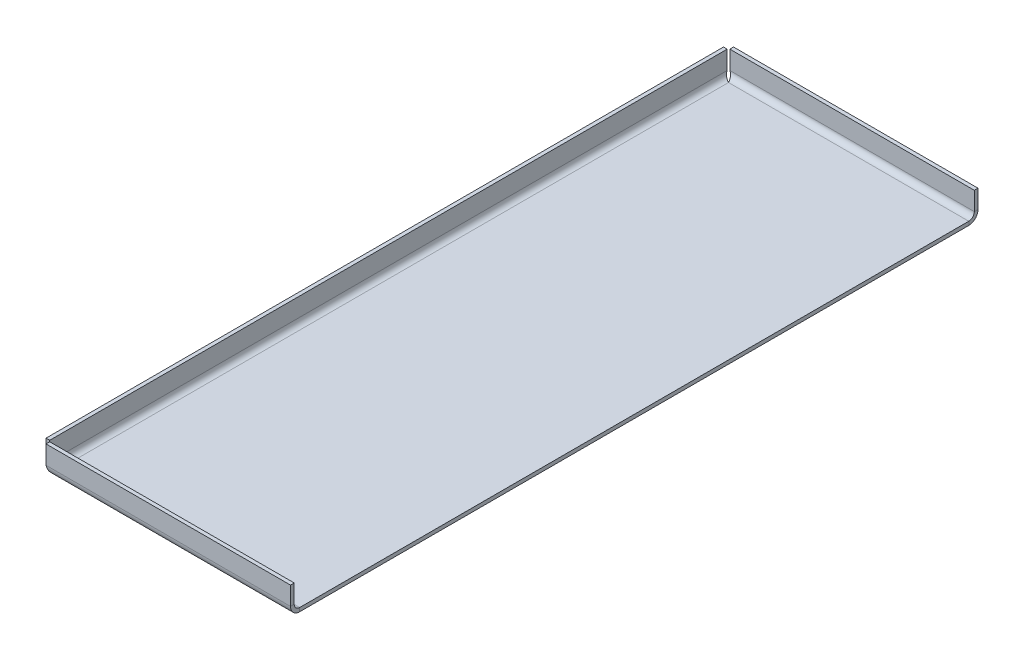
ISO-10303-21;
HEADER;
FILE_DESCRIPTION(('STEP AP214'),'2;1');
FILE_NAME('part.step','',(''),(''),'','','');
FILE_SCHEMA(('AUTOMOTIVE_DESIGN { 1 0 10303 214 1 1 1 1 }'));
ENDSEC;
DATA;
#1=APPLICATION_CONTEXT('core data for automotive mechanical design processes');
#2=APPLICATION_PROTOCOL_DEFINITION('international standard','automotive_design',2000,#1);
#3=PRODUCT_CONTEXT('',#1,'mechanical');
#4=PRODUCT('Part','Part','',(#3));
#5=PRODUCT_RELATED_PRODUCT_CATEGORY('part','',(#4));
#6=PRODUCT_DEFINITION_FORMATION('','',#4);
#7=PRODUCT_DEFINITION_CONTEXT('part definition',#1,'design');
#8=PRODUCT_DEFINITION('design','',#6,#7);
#9=PRODUCT_DEFINITION_SHAPE('','',#8);
#10=(LENGTH_UNIT() NAMED_UNIT(*) SI_UNIT(.MILLI.,.METRE.));
#11=(NAMED_UNIT(*) PLANE_ANGLE_UNIT() SI_UNIT($,.RADIAN.));
#12=(NAMED_UNIT(*) SI_UNIT($,.STERADIAN.) SOLID_ANGLE_UNIT());
#13=UNCERTAINTY_MEASURE_WITH_UNIT(LENGTH_MEASURE(1.E-05),#10,'distance_accuracy_value','');
#14=(GEOMETRIC_REPRESENTATION_CONTEXT(3) GLOBAL_UNCERTAINTY_ASSIGNED_CONTEXT((#13)) GLOBAL_UNIT_ASSIGNED_CONTEXT((#10,
#11,#12)) REPRESENTATION_CONTEXT('',''));
#15=CARTESIAN_POINT('',(0.,0.,0.));
#16=DIRECTION('',(0.,0.,1.));
#17=DIRECTION('',(1.,0.,0.));
#18=AXIS2_PLACEMENT_3D('',#15,#16,#17);
#19=CARTESIAN_POINT('',(-65.,-2.,181.));
#20=DIRECTION('',(0.,1.,0.));
#21=DIRECTION('',(-1.,0.,0.));
#22=AXIS2_PLACEMENT_3D('',#19,#20,#21);
#23=PLANE('',#22);
#24=DIRECTION('',(1.,0.,0.));
#25=VECTOR('',#24,1.);
#26=CARTESIAN_POINT('',(-65.,-2.,-181.));
#27=LINE('',#26,#25);
#28=CARTESIAN_POINT('',(-65.,-1.99999999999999,-181.));
#29=VERTEX_POINT('',#28);
#30=CARTESIAN_POINT('',(65.,-1.99999999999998,-181.));
#31=VERTEX_POINT('',#30);
#32=EDGE_CURVE('E314',#29,#31,#27,.T.);
#33=ORIENTED_EDGE('',*,*,#32,.T.);
#34=DIRECTION('',(0.,0.,-1.));
#35=VECTOR('',#34,1.);
#36=CARTESIAN_POINT('',(65.,-1.99999999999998,181.));
#37=LINE('',#36,#35);
#38=CARTESIAN_POINT('',(65.,-2.,181.));
#39=VERTEX_POINT('',#38);
#40=EDGE_CURVE('E15',#39,#31,#37,.T.);
#41=ORIENTED_EDGE('',*,*,#40,.F.);
#42=DIRECTION('',(1.,0.,0.));
#43=VECTOR('',#42,1.);
#44=CARTESIAN_POINT('',(-65.,-2.,181.));
#45=LINE('',#44,#43);
#46=CARTESIAN_POINT('',(-65.,-2.,181.));
#47=VERTEX_POINT('',#46);
#48=EDGE_CURVE('E334',#47,#39,#45,.T.);
#49=ORIENTED_EDGE('',*,*,#48,.F.);
#50=DIRECTION('',(0.,0.,-1.));
#51=VECTOR('',#50,1.);
#52=CARTESIAN_POINT('',(-65.,-2.,181.));
#53=LINE('',#52,#51);
#54=EDGE_CURVE('E317',#47,#29,#53,.T.);
#55=ORIENTED_EDGE('',*,*,#54,.T.);
#56=EDGE_LOOP('',(#33,#41,#49,#55));
#57=FACE_BOUND('',#56,.T.);
#58=ADVANCED_FACE('F106',(#57),#23,.F.);
#59=CARTESIAN_POINT('',(65.,0.,181.));
#60=DIRECTION('',(1.,0.,0.));
#61=DIRECTION('',(0.,0.,-1.));
#62=AXIS2_PLACEMENT_3D('',#59,#60,#61);
#63=PLANE('',#62);
#64=DIRECTION('',(0.,-1.,0.));
#65=VECTOR('',#64,1.);
#66=CARTESIAN_POINT('',(65.,0.,-181.));
#67=LINE('',#66,#65);
#68=CARTESIAN_POINT('',(65.,0.,-181.));
#69=VERTEX_POINT('',#68);
#70=EDGE_CURVE('E318',#69,#31,#67,.T.);
#71=ORIENTED_EDGE('',*,*,#70,.F.);
#72=DIRECTION('',(0.,0.,-1.));
#73=VECTOR('',#72,1.);
#74=CARTESIAN_POINT('',(65.,0.,181.));
#75=LINE('',#74,#73);
#76=CARTESIAN_POINT('',(65.,0.,181.));
#77=VERTEX_POINT('',#76);
#78=EDGE_CURVE('E114',#77,#69,#75,.T.);
#79=ORIENTED_EDGE('',*,*,#78,.F.);
#80=DIRECTION('',(0.,-1.,0.));
#81=VECTOR('',#80,1.);
#82=CARTESIAN_POINT('',(65.,0.,181.));
#83=LINE('',#82,#81);
#84=EDGE_CURVE('E457',#77,#39,#83,.T.);
#85=ORIENTED_EDGE('',*,*,#84,.T.);
#86=ORIENTED_EDGE('',*,*,#40,.T.);
#87=EDGE_LOOP('',(#71,#79,#85,#86));
#88=FACE_BOUND('',#87,.T.);
#89=ADVANCED_FACE('F305',(#88),#63,.T.);
#90=CARTESIAN_POINT('',(-65.,0.,181.));
#91=DIRECTION('',(0.,1.,0.));
#92=DIRECTION('',(-1.,0.,0.));
#93=AXIS2_PLACEMENT_3D('',#90,#91,#92);
#94=PLANE('',#93);
#95=DIRECTION('',(1.,0.,0.));
#96=VECTOR('',#95,1.);
#97=CARTESIAN_POINT('',(-65.,0.,-181.));
#98=LINE('',#97,#96);
#99=CARTESIAN_POINT('',(-65.,0.,-181.));
#100=VERTEX_POINT('',#99);
#101=EDGE_CURVE('E322',#100,#69,#98,.T.);
#102=ORIENTED_EDGE('',*,*,#101,.F.);
#103=DIRECTION('',(0.,0.,-1.));
#104=VECTOR('',#103,1.);
#105=CARTESIAN_POINT('',(-65.,0.,181.));
#106=LINE('',#105,#104);
#107=CARTESIAN_POINT('',(-65.,0.,181.));
#108=VERTEX_POINT('',#107);
#109=EDGE_CURVE('E336',#108,#100,#106,.T.);
#110=ORIENTED_EDGE('',*,*,#109,.F.);
#111=DIRECTION('',(1.,0.,0.));
#112=VECTOR('',#111,1.);
#113=CARTESIAN_POINT('',(-65.,0.,181.));
#114=LINE('',#113,#112);
#115=EDGE_CURVE('E342',#108,#77,#114,.T.);
#116=ORIENTED_EDGE('',*,*,#115,.T.);
#117=ORIENTED_EDGE('',*,*,#78,.T.);
#118=EDGE_LOOP('',(#102,#110,#116,#117));
#119=FACE_BOUND('',#118,.T.);
#120=ADVANCED_FACE('F310',(#119),#94,.T.);
#121=CARTESIAN_POINT('',(-65.,-2.02,181.));
#122=CARTESIAN_POINT('',(-65.1911062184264,-2.02,181.657225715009));
#123=CARTESIAN_POINT('',(-65.3821488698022,-1.88934283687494,182.313974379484));
#124=CARTESIAN_POINT('',(-65.7642977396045,-1.38640766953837,183.528167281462));
#125=CARTESIAN_POINT('',(-65.9553721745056,-1.01432754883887,184.085024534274));
#126=CARTESIAN_POINT('',(-66.3375210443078,-0.0850245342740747,185.014327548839));
#127=CARTESIAN_POINT('',(-66.528595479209,0.471832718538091,185.386407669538));
#128=CARTESIAN_POINT('',(-66.9107443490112,1.68602562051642,185.889342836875));
#129=CARTESIAN_POINT('',(-67.101787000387,2.34277428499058,186.02));
#130=CARTESIAN_POINT('',(-67.2928932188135,3.,186.02));
#131=CARTESIAN_POINT('',(-65.,-2.,181.));
#132=CARTESIAN_POINT('',(-65.1911061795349,-2.,181.654607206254));
#133=CARTESIAN_POINT('',(-65.3821488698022,-1.86986338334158,182.308739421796));
#134=CARTESIAN_POINT('',(-65.7642977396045,-1.36893194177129,183.518094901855));
#135=CARTESIAN_POINT('',(-65.9553721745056,-0.998334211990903,184.072733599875));
#136=CARTESIAN_POINT('',(-66.3375210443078,-0.0727335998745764,184.998334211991));
#137=CARTESIAN_POINT('',(-66.528595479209,0.481905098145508,185.368931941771));
#138=CARTESIAN_POINT('',(-66.9107443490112,1.6912605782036,185.869863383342));
#139=CARTESIAN_POINT('',(-67.1017870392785,2.34539279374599,186.));
#140=CARTESIAN_POINT('',(-67.2928932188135,3.,186.));
#141=CARTESIAN_POINT('',(-65.,0.,181.));
#142=CARTESIAN_POINT('',(-65.1911022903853,0.,181.392756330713));
#143=CARTESIAN_POINT('',(-65.3821488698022,0.0780819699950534,181.785243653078));
#144=CARTESIAN_POINT('',(-65.7642977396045,0.378640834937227,182.510856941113));
#145=CARTESIAN_POINT('',(-65.9553721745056,0.60099947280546,182.843640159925));
#146=CARTESIAN_POINT('',(-66.3375210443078,1.15635984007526,183.399000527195));
#147=CARTESIAN_POINT('',(-66.528595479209,1.4891430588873,183.621359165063));
#148=CARTESIAN_POINT('',(-66.9107443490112,2.21475634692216,183.921918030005));
#149=CARTESIAN_POINT('',(-67.1017909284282,2.60724366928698,184.));
#150=CARTESIAN_POINT('',(-67.2928932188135,3.,184.));
#151=CARTESIAN_POINT('',(-65.,0.0202,181.));
#152=CARTESIAN_POINT('',(-65.1911022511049,0.0202,181.39011163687));
#153=CARTESIAN_POINT('',(-65.3821488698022,0.0977562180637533,181.779956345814));
#154=CARTESIAN_POINT('',(-65.7642977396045,0.396291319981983,182.500683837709));
#155=CARTESIAN_POINT('',(-65.9553721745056,0.617152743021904,182.831226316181));
#156=CARTESIAN_POINT('',(-66.3375210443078,1.16877368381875,183.382847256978));
#157=CARTESIAN_POINT('',(-66.528595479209,1.4993161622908,183.603708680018));
#158=CARTESIAN_POINT('',(-66.9107443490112,2.22004365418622,183.902243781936));
#159=CARTESIAN_POINT('',(-67.1017909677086,2.60988836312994,183.9798));
#160=CARTESIAN_POINT('',(-67.2928932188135,3.,183.9798));
#161=B_SPLINE_SURFACE_WITH_KNOTS('',1,3,((#121,#122,#123,#124,#125,#126,#127,#128,#129,#130),
(#131,#132,#133,#134,#135,#136,#137,#138,#139,#140),(#141,#142,#143,#144,#145,#146,#147,#148,
#149,#150),(#151,#152,#153,#154,#155,#156,#157,#158,#159,#160)),.UNSPECIFIED.,.F.,.F.,.F.,(2,1,
1,2),(4,2,2,2,4),(-0.01,0.,1.,1.0101),(0.,0.25,0.5,0.75,1.),.UNSPECIFIED.);
#162=DIRECTION('',(0.,0.,-1.));
#163=VECTOR('',#162,1.);
#164=CARTESIAN_POINT('',(-67.2928932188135,3.,186.));
#165=LINE('',#164,#163);
#166=CARTESIAN_POINT('',(-67.2928932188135,3.,184.));
#167=VERTEX_POINT('',#166);
#168=CARTESIAN_POINT('',(-67.2928932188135,3.,186.));
#169=VERTEX_POINT('',#168);
#170=EDGE_CURVE('E411',#167,#169,#165,.F.);
#171=CARTESIAN_POINT('',(-65.,0.,181.));
#172=CARTESIAN_POINT('',(-65.0376268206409,1.51104761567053E-06,181.077326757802));
#173=CARTESIAN_POINT('',(-65.0752368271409,0.00299177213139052,181.154621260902));
#174=CARTESIAN_POINT('',(-65.1504499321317,0.0149267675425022,181.308737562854));
#175=CARTESIAN_POINT('',(-65.1880530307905,0.0238705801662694,181.385559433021));
#176=CARTESIAN_POINT('',(-65.3009110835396,0.0595997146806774,181.614743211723));
#177=CARTESIAN_POINT('',(-65.3762132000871,0.0952827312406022,181.765819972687));
#178=CARTESIAN_POINT('',(-65.4971393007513,0.17091551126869,182.00256013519));
#179=CARTESIAN_POINT('',(-65.5427981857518,0.203679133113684,182.090600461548));
#180=CARTESIAN_POINT('',(-65.6341141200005,0.277306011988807,182.263220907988));
#181=CARTESIAN_POINT('',(-65.6797711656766,0.318166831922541,182.347802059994));
#182=CARTESIAN_POINT('',(-65.7710969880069,0.40765063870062,182.512792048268));
#183=CARTESIAN_POINT('',(-65.8167657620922,0.456276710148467,182.593199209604));
#184=CARTESIAN_POINT('',(-65.9080868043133,0.560831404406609,182.749073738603));
#185=CARTESIAN_POINT('',(-65.953739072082,0.616757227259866,182.824542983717));
#186=CARTESIAN_POINT('',(-66.0450658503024,0.735457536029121,182.969938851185));
#187=CARTESIAN_POINT('',(-66.0907403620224,0.79823489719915,183.039863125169));
#188=CARTESIAN_POINT('',(-66.1820724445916,0.930043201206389,183.173495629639));
#189=CARTESIAN_POINT('',(-66.2277300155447,0.999071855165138,183.237206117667));
#190=CARTESIAN_POINT('',(-66.3190759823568,1.14284769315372,183.357923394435));
#191=CARTESIAN_POINT('',(-66.3647643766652,1.21759897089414,183.414925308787));
#192=CARTESIAN_POINT('',(-66.4561228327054,1.37208896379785,183.521649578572));
#193=CARTESIAN_POINT('',(-66.5017928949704,1.45182582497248,183.571374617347));
#194=CARTESIAN_POINT('',(-66.5931777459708,1.61568068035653,183.66317234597));
#195=CARTESIAN_POINT('',(-66.6388925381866,1.69980252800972,183.705238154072));
#196=CARTESIAN_POINT('',(-66.7303046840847,1.8715900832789,183.781278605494));
#197=CARTESIAN_POINT('',(-66.7760020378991,1.95925445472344,183.815256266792));
#198=CARTESIAN_POINT('',(-66.8673496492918,2.13729399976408,183.874811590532));
#199=CARTESIAN_POINT('',(-66.9129999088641,2.22766641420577,183.900397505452));
#200=CARTESIAN_POINT('',(-67.0042803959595,2.41037715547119,183.94298119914));
#201=CARTESIAN_POINT('',(-67.0499106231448,2.5027145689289,183.959982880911));
#202=CARTESIAN_POINT('',(-67.1284583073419,2.66267690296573,183.981743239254));
#203=CARTESIAN_POINT('',(-67.1613778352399,2.73002392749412,183.988592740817));
#204=CARTESIAN_POINT('',(-67.2271616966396,2.86491202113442,183.997718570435));
#205=CARTESIAN_POINT('',(-67.2600260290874,2.93245256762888,184.000002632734));
#206=CARTESIAN_POINT('',(-67.2928932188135,3.,184.));
#207=B_SPLINE_CURVE_WITH_KNOTS('',3,(#171,#172,#173,#174,#175,#176,#177,#178,#179,#180,#181,
#182,#183,#184,#185,#186,#187,#188,#189,#190,#191,#192,#193,#194,#195,#196,#197,#198,#199,#200,
#201,#202,#203,#204,#205,#206),.UNSPECIFIED.,.F.,.F.,(4,2,2,2,2,2,2,2,2,2,2,2,2,2,2,2,2,4),(0.,
0.257861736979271,0.515683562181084,1.03133815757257,1.34437075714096,1.65730928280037,
1.97037242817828,2.28331584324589,2.59639109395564,2.90935217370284,3.2225392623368,
3.53561057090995,3.84896179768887,4.16219591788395,4.47512107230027,4.78790382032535,
5.01359498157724,5.23890347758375),.UNSPECIFIED.);
#208=EDGE_CURVE('E461',#108,#167,#207,.T.);
#209=DIRECTION('',(0.,1.,0.));
#210=VECTOR('',#209,1.);
#211=CARTESIAN_POINT('',(-65.,-2.,181.));
#212=LINE('',#211,#210);
#213=EDGE_CURVE('E328',#47,#108,#212,.T.);
#214=CARTESIAN_POINT('',(-65.,-2.,181.));
#215=CARTESIAN_POINT('',(-65.0427750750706,-2.0000177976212,181.146513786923));
#216=CARTESIAN_POINT('',(-65.0855492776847,-1.99356086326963,181.293025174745));
#217=CARTESIAN_POINT('',(-65.1710936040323,-1.96782600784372,181.584910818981));
#218=CARTESIAN_POINT('',(-65.2138637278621,-1.94854875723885,181.730285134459));
#219=CARTESIAN_POINT('',(-65.2993685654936,-1.89732177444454,182.018666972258));
#220=CARTESIAN_POINT('',(-65.3421032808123,-1.86538197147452,182.161676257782));
#221=CARTESIAN_POINT('',(-65.4275760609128,-1.78908251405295,182.444338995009));
#222=CARTESIAN_POINT('',(-65.4703141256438,-1.74472302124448,182.583992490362));
#223=CARTESIAN_POINT('',(-65.5558130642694,-1.64389688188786,182.858944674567));
#224=CARTESIAN_POINT('',(-65.5985739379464,-1.58742367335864,182.994240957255));
#225=CARTESIAN_POINT('',(-65.684111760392,-1.46279771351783,183.259403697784));
#226=CARTESIAN_POINT('',(-65.7268887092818,-1.39464066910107,183.389268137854));
#227=CARTESIAN_POINT('',(-65.8124134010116,-1.24723060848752,183.642437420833));
#228=CARTESIAN_POINT('',(-65.8551611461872,-1.16798416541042,183.765746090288));
#229=CARTESIAN_POINT('',(-65.9406737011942,-0.99894774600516,184.004975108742));
#230=CARTESIAN_POINT('',(-65.9834385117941,-0.909154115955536,184.120892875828));
#231=CARTESIAN_POINT('',(-66.0689602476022,-0.71976035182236,184.344373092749));
#232=CARTESIAN_POINT('',(-66.1117171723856,-0.62016245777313,184.451937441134));
#233=CARTESIAN_POINT('',(-66.1972313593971,-0.411911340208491,184.657910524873));
#234=CARTESIAN_POINT('',(-66.2399886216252,-0.303258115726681,184.756319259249));
#235=CARTESIAN_POINT('',(-66.3255224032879,-0.0776757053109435,184.943270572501));
#236=CARTESIAN_POINT('',(-66.36829892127,0.0392577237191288,185.031808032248));
#237=CARTESIAN_POINT('',(-66.4538357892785,0.280405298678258,185.198244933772));
#238=CARTESIAN_POINT('',(-66.4965961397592,0.404616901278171,185.276148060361));
#239=CARTESIAN_POINT('',(-66.5821520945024,0.65949062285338,185.420803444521));
#240=CARTESIAN_POINT('',(-66.6249477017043,0.790157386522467,185.487547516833));
#241=CARTESIAN_POINT('',(-66.7105224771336,1.0567995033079,185.609277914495));
#242=CARTESIAN_POINT('',(-66.753301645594,1.19277287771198,185.66426857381));
#243=CARTESIAN_POINT('',(-66.8388291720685,1.46892342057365,185.762063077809));
#244=CARTESIAN_POINT('',(-66.8815775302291,1.60909751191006,185.804875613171));
#245=CARTESIAN_POINT('',(-66.9670552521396,1.89261168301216,185.878023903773));
#246=CARTESIAN_POINT('',(-67.0097846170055,2.03595055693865,185.908364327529));
#247=CARTESIAN_POINT('',(-67.0926116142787,2.31583502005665,185.954874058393));
#248=CARTESIAN_POINT('',(-67.1327092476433,2.45225527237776,185.971801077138));
#249=CARTESIAN_POINT('',(-67.2128351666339,2.7257830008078,185.994360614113));
#250=CARTESIAN_POINT('',(-67.2528634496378,2.86288883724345,186.000013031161));
#251=CARTESIAN_POINT('',(-67.2928932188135,3.,186.));
#252=B_SPLINE_CURVE_WITH_KNOTS('',3,(#214,#215,#216,#217,#218,#219,#220,#221,#222,#223,#224,
#225,#226,#227,#228,#229,#230,#231,#232,#233,#234,#235,#236,#237,#238,#239,#240,#241,#242,#243,
#244,#245,#246,#247,#248,#249,#250,#251),.UNSPECIFIED.,.F.,.F.,(4,2,2,2,2,2,2,2,2,2,2,2,2,2,2,2,
2,2,4),(0.,0.45775068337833,0.915477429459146,1.37284596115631,1.83020854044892,
2.28781950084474,2.74559896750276,3.20310823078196,3.66077645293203,4.11834035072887,
4.57590429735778,5.03370443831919,5.49134554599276,5.94932087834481,6.40712704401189,
6.86460568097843,7.32191291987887,7.75105444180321,8.17943788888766),.UNSPECIFIED.);
#253=EDGE_CURVE('E319',#47,#169,#252,.T.);
#254=ORIENTED_EDGE('',*,*,#170,.F.);
#255=ORIENTED_EDGE('',*,*,#208,.F.);
#256=ORIENTED_EDGE('',*,*,#213,.F.);
#257=ORIENTED_EDGE('',*,*,#253,.T.);
#258=EDGE_LOOP('',(#254,#255,#256,#257));
#259=FACE_BOUND('',#258,.T.);
#260=ADVANCED_FACE('F474',(#259),#161,.F.);
#261=CARTESIAN_POINT('',(65.,3.,181.));
#262=DIRECTION('',(-1.,0.,0.));
#263=DIRECTION('',(0.,0.,1.));
#264=AXIS2_PLACEMENT_3D('',#261,#262,#263);
#265=PLANE('',#264);
#266=CARTESIAN_POINT('',(65.,3.,181.));
#267=DIRECTION('',(1.,0.,0.));
#268=DIRECTION('',(0.,0.,-1.));
#269=AXIS2_PLACEMENT_3D('',#266,#267,#268);
#270=CIRCLE('',#269,3.);
#271=CARTESIAN_POINT('',(65.,3.,184.));
#272=VERTEX_POINT('',#271);
#273=EDGE_CURVE('E468',#272,#77,#270,.T.);
#274=ORIENTED_EDGE('',*,*,#273,.F.);
#275=DIRECTION('',(0.,0.,-1.));
#276=VECTOR('',#275,1.);
#277=CARTESIAN_POINT('',(65.,3.,184.));
#278=LINE('',#277,#276);
#279=CARTESIAN_POINT('',(65.,3.,186.));
#280=VERTEX_POINT('',#279);
#281=EDGE_CURVE('E789',#272,#280,#278,.F.);
#282=ORIENTED_EDGE('',*,*,#281,.T.);
#283=CARTESIAN_POINT('',(65.,3.,181.));
#284=DIRECTION('',(1.,0.,0.));
#285=DIRECTION('',(0.,0.,-1.));
#286=AXIS2_PLACEMENT_3D('',#283,#284,#285);
#287=CIRCLE('',#286,5.);
#288=EDGE_CURVE('E325',#280,#39,#287,.T.);
#289=ORIENTED_EDGE('',*,*,#288,.T.);
#290=ORIENTED_EDGE('',*,*,#84,.F.);
#291=EDGE_LOOP('',(#274,#282,#289,#290));
#292=FACE_BOUND('',#291,.T.);
#293=ADVANCED_FACE('F485',(#292),#265,.F.);
#294=CARTESIAN_POINT('',(65.,3.,181.));
#295=DIRECTION('',(1.,0.,0.));
#296=DIRECTION('',(0.,0.,1.));
#297=AXIS2_PLACEMENT_3D('',#294,#295,#296);
#298=CYLINDRICAL_SURFACE('',#297,5.);
#299=ORIENTED_EDGE('',*,*,#48,.T.);
#300=ORIENTED_EDGE('',*,*,#288,.F.);
#301=DIRECTION('',(1.,0.,0.));
#302=VECTOR('',#301,1.);
#303=CARTESIAN_POINT('',(-65.,3.,186.));
#304=LINE('',#303,#302);
#305=EDGE_CURVE('E812',#280,#169,#304,.F.);
#306=ORIENTED_EDGE('',*,*,#305,.T.);
#307=ORIENTED_EDGE('',*,*,#253,.F.);
#308=EDGE_LOOP('',(#299,#300,#306,#307));
#309=FACE_BOUND('',#308,.T.);
#310=ADVANCED_FACE('F483',(#309),#298,.T.);
#311=CARTESIAN_POINT('',(65.,3.,181.));
#312=DIRECTION('',(1.,0.,0.));
#313=DIRECTION('',(0.,0.,1.));
#314=AXIS2_PLACEMENT_3D('',#311,#312,#313);
#315=CYLINDRICAL_SURFACE('',#314,3.);
#316=ORIENTED_EDGE('',*,*,#115,.F.);
#317=ORIENTED_EDGE('',*,*,#208,.T.);
#318=DIRECTION('',(1.,0.,0.));
#319=VECTOR('',#318,1.);
#320=CARTESIAN_POINT('',(-65.,3.,184.));
#321=LINE('',#320,#319);
#322=EDGE_CURVE('E782',#167,#272,#321,.T.);
#323=ORIENTED_EDGE('',*,*,#322,.T.);
#324=ORIENTED_EDGE('',*,*,#273,.T.);
#325=EDGE_LOOP('',(#316,#317,#323,#324));
#326=FACE_BOUND('',#325,.T.);
#327=ADVANCED_FACE('F479',(#326),#315,.F.);
#328=CARTESIAN_POINT('',(65.,13.,186.));
#329=DIRECTION('',(-1.,0.,0.));
#330=DIRECTION('',(0.,0.,1.));
#331=AXIS2_PLACEMENT_3D('',#328,#329,#330);
#332=PLANE('',#331);
#333=ORIENTED_EDGE('',*,*,#281,.F.);
#334=DIRECTION('',(0.,-1.,0.));
#335=VECTOR('',#334,1.);
#336=CARTESIAN_POINT('',(65.,13.,184.));
#337=LINE('',#336,#335);
#338=CARTESIAN_POINT('',(65.,13.,184.));
#339=VERTEX_POINT('',#338);
#340=EDGE_CURVE('E788',#272,#339,#337,.F.);
#341=ORIENTED_EDGE('',*,*,#340,.T.);
#342=DIRECTION('',(0.,0.,-1.));
#343=VECTOR('',#342,1.);
#344=CARTESIAN_POINT('',(65.,13.,186.));
#345=LINE('',#344,#343);
#346=CARTESIAN_POINT('',(65.,13.,186.));
#347=VERTEX_POINT('',#346);
#348=EDGE_CURVE('E800',#347,#339,#345,.T.);
#349=ORIENTED_EDGE('',*,*,#348,.F.);
#350=DIRECTION('',(0.,1.,0.));
#351=VECTOR('',#350,1.);
#352=CARTESIAN_POINT('',(65.,13.,186.));
#353=LINE('',#352,#351);
#354=EDGE_CURVE('E805',#280,#347,#353,.T.);
#355=ORIENTED_EDGE('',*,*,#354,.F.);
#356=EDGE_LOOP('',(#333,#341,#349,#355));
#357=FACE_BOUND('',#356,.T.);
#358=ADVANCED_FACE('F482',(#357),#332,.F.);
#359=CARTESIAN_POINT('',(-65.,13.,186.));
#360=DIRECTION('',(0.,0.,-1.));
#361=DIRECTION('',(-1.,0.,0.));
#362=AXIS2_PLACEMENT_3D('',#359,#360,#361);
#363=PLANE('',#362);
#364=ORIENTED_EDGE('',*,*,#305,.F.);
#365=ORIENTED_EDGE('',*,*,#354,.T.);
#366=DIRECTION('',(-1.,0.,0.));
#367=VECTOR('',#366,1.);
#368=CARTESIAN_POINT('',(-65.,13.,186.));
#369=LINE('',#368,#367);
#370=CARTESIAN_POINT('',(-67.2928932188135,13.,186.));
#371=VERTEX_POINT('',#370);
#372=EDGE_CURVE('E802',#347,#371,#369,.T.);
#373=ORIENTED_EDGE('',*,*,#372,.T.);
#374=DIRECTION('',(0.,-1.,0.));
#375=VECTOR('',#374,1.);
#376=CARTESIAN_POINT('',(-67.2928932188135,13.,186.));
#377=LINE('',#376,#375);
#378=EDGE_CURVE('E778',#371,#169,#377,.T.);
#379=ORIENTED_EDGE('',*,*,#378,.T.);
#380=EDGE_LOOP('',(#364,#365,#373,#379));
#381=FACE_BOUND('',#380,.T.);
#382=ADVANCED_FACE('F492',(#381),#363,.F.);
#383=CARTESIAN_POINT('',(-65.,13.,184.));
#384=DIRECTION('',(0.,0.,-1.));
#385=DIRECTION('',(-1.,0.,0.));
#386=AXIS2_PLACEMENT_3D('',#383,#384,#385);
#387=PLANE('',#386);
#388=ORIENTED_EDGE('',*,*,#340,.F.);
#389=ORIENTED_EDGE('',*,*,#322,.F.);
#390=DIRECTION('',(0.,1.,0.));
#391=VECTOR('',#390,1.);
#392=CARTESIAN_POINT('',(-67.2928932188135,0.,184.));
#393=LINE('',#392,#391);
#394=CARTESIAN_POINT('',(-67.2928932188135,13.,184.));
#395=VERTEX_POINT('',#394);
#396=EDGE_CURVE('E787',#395,#167,#393,.F.);
#397=ORIENTED_EDGE('',*,*,#396,.F.);
#398=DIRECTION('',(1.,0.,0.));
#399=VECTOR('',#398,1.);
#400=CARTESIAN_POINT('',(-65.,13.,184.));
#401=LINE('',#400,#399);
#402=EDGE_CURVE('E809',#339,#395,#401,.F.);
#403=ORIENTED_EDGE('',*,*,#402,.F.);
#404=EDGE_LOOP('',(#388,#389,#397,#403));
#405=FACE_BOUND('',#404,.T.);
#406=ADVANCED_FACE('F498',(#405),#387,.T.);
#407=CARTESIAN_POINT('',(-65.,13.,186.));
#408=DIRECTION('',(0.,-1.,0.));
#409=DIRECTION('',(0.,0.,-1.));
#410=AXIS2_PLACEMENT_3D('',#407,#408,#409);
#411=PLANE('',#410);
#412=ORIENTED_EDGE('',*,*,#402,.T.);
#413=DIRECTION('',(0.,0.,-1.));
#414=VECTOR('',#413,1.);
#415=CARTESIAN_POINT('',(-67.2928932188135,13.,186.));
#416=LINE('',#415,#414);
#417=EDGE_CURVE('E793',#371,#395,#416,.T.);
#418=ORIENTED_EDGE('',*,*,#417,.F.);
#419=ORIENTED_EDGE('',*,*,#372,.F.);
#420=ORIENTED_EDGE('',*,*,#348,.T.);
#421=EDGE_LOOP('',(#412,#418,#419,#420));
#422=FACE_BOUND('',#421,.T.);
#423=ADVANCED_FACE('F494',(#422),#411,.F.);
#424=CARTESIAN_POINT('',(-67.2928932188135,0.,186.));
#425=DIRECTION('',(1.,0.,0.));
#426=DIRECTION('',(0.,0.,-1.));
#427=AXIS2_PLACEMENT_3D('',#424,#425,#426);
#428=PLANE('',#427);
#429=ORIENTED_EDGE('',*,*,#170,.T.);
#430=ORIENTED_EDGE('',*,*,#378,.F.);
#431=ORIENTED_EDGE('',*,*,#417,.T.);
#432=ORIENTED_EDGE('',*,*,#396,.T.);
#433=EDGE_LOOP('',(#429,#430,#431,#432));
#434=FACE_BOUND('',#433,.T.);
#435=ADVANCED_FACE('F497',(#434),#428,.F.);
#436=CARTESIAN_POINT('',(-65.,-2.02,-181.));
#437=CARTESIAN_POINT('',(-65.6572257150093,-2.02,-181.191106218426));
#438=CARTESIAN_POINT('',(-66.3139743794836,-1.88934283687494,-181.382148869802));
#439=CARTESIAN_POINT('',(-67.5281672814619,-1.38640766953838,-181.764297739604));
#440=CARTESIAN_POINT('',(-68.0850245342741,-1.01432754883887,-181.955372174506));
#441=CARTESIAN_POINT('',(-69.0143275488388,-0.0850245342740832,-182.337521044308));
#442=CARTESIAN_POINT('',(-69.3864076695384,0.471832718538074,-182.528595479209));
#443=CARTESIAN_POINT('',(-69.8893428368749,1.6860256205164,-182.910744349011));
#444=CARTESIAN_POINT('',(-70.02,2.34277428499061,-183.101787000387));
#445=CARTESIAN_POINT('',(-70.02,2.99999999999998,-183.292893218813));
#446=CARTESIAN_POINT('',(-65.,-2.,-181.));
#447=CARTESIAN_POINT('',(-65.6546072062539,-2.,-181.191106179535));
#448=CARTESIAN_POINT('',(-66.3087394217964,-1.86986338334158,-181.382148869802));
#449=CARTESIAN_POINT('',(-67.5180949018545,-1.36893194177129,-181.764297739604));
#450=CARTESIAN_POINT('',(-68.0727335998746,-0.998334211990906,-181.955372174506));
#451=CARTESIAN_POINT('',(-68.9983342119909,-0.0727335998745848,-182.337521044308));
#452=CARTESIAN_POINT('',(-69.3689319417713,0.481905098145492,-182.528595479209));
#453=CARTESIAN_POINT('',(-69.8698633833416,1.69126057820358,-182.910744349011));
#454=CARTESIAN_POINT('',(-70.,2.34539279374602,-183.101787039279));
#455=CARTESIAN_POINT('',(-70.,2.99999999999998,-183.292893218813));
#456=CARTESIAN_POINT('',(-65.,0.,-181.));
#457=CARTESIAN_POINT('',(-65.392756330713,0.,-181.191102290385));
#458=CARTESIAN_POINT('',(-65.7852436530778,0.0780819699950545,-181.382148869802));
#459=CARTESIAN_POINT('',(-66.5108569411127,0.378640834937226,-181.764297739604));
#460=CARTESIAN_POINT('',(-66.8436401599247,0.600999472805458,-181.955372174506));
#461=CARTESIAN_POINT('',(-67.3990005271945,1.15635984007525,-182.337521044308));
#462=CARTESIAN_POINT('',(-67.6213591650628,1.4891430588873,-182.528595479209));
#463=CARTESIAN_POINT('',(-67.921918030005,2.21475634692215,-182.910744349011));
#464=CARTESIAN_POINT('',(-68.,2.607243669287,-183.101790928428));
#465=CARTESIAN_POINT('',(-68.,2.99999999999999,-183.292893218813));
#466=CARTESIAN_POINT('',(-65.,0.0202000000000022,-181.));
#467=CARTESIAN_POINT('',(-65.39011163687,0.0202000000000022,-181.191102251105));
#468=CARTESIAN_POINT('',(-65.7799563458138,0.0977562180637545,-181.382148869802));
#469=CARTESIAN_POINT('',(-66.5006838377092,0.396291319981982,-181.764297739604));
#470=CARTESIAN_POINT('',(-66.8312263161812,0.617152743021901,-181.955372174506));
#471=CARTESIAN_POINT('',(-67.3828472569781,1.16877368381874,-182.337521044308));
#472=CARTESIAN_POINT('',(-67.603708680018,1.49931616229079,-182.528595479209));
#473=CARTESIAN_POINT('',(-67.9022437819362,2.22004365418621,-182.910744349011));
#474=CARTESIAN_POINT('',(-67.9798,2.60988836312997,-183.101790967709));
#475=CARTESIAN_POINT('',(-67.9798,2.99999999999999,-183.292893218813));
#476=B_SPLINE_SURFACE_WITH_KNOTS('',1,3,((#436,#437,#438,#439,#440,#441,#442,#443,#444,#445),
(#446,#447,#448,#449,#450,#451,#452,#453,#454,#455),(#456,#457,#458,#459,#460,#461,#462,#463,
#464,#465),(#466,#467,#468,#469,#470,#471,#472,#473,#474,#475)),.UNSPECIFIED.,.F.,.F.,.F.,(2,1,
1,2),(4,2,2,2,4),(-0.01,0.,1.,1.0101),(0.,0.25,0.5,0.75,1.),.UNSPECIFIED.);
#477=DIRECTION('',(1.,0.,0.));
#478=VECTOR('',#477,1.);
#479=CARTESIAN_POINT('',(-70.,2.99999999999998,-183.292893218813));
#480=LINE('',#479,#478);
#481=CARTESIAN_POINT('',(-68.,3.,-183.292893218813));
#482=VERTEX_POINT('',#481);
#483=CARTESIAN_POINT('',(-70.,2.99999999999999,-183.292893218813));
#484=VERTEX_POINT('',#483);
#485=EDGE_CURVE('E260',#482,#484,#480,.F.);
#486=CARTESIAN_POINT('',(-65.,0.,-181.));
#487=CARTESIAN_POINT('',(-65.0773267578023,1.51104761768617E-06,-181.037626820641));
#488=CARTESIAN_POINT('',(-65.1546212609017,0.00299177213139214,-181.075236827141));
#489=CARTESIAN_POINT('',(-65.3087375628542,0.0149267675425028,-181.150449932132));
#490=CARTESIAN_POINT('',(-65.3855594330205,0.0238705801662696,-181.188053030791));
#491=CARTESIAN_POINT('',(-65.6147432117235,0.0595997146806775,-181.30091108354));
#492=CARTESIAN_POINT('',(-65.7658199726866,0.095282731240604,-181.376213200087));
#493=CARTESIAN_POINT('',(-66.0025601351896,0.170915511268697,-181.497139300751));
#494=CARTESIAN_POINT('',(-66.0906004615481,0.203679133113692,-181.542798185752));
#495=CARTESIAN_POINT('',(-66.2632209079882,0.27730601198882,-181.63411412));
#496=CARTESIAN_POINT('',(-66.3478020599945,0.31816683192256,-181.679771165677));
#497=CARTESIAN_POINT('',(-66.5127920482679,0.407650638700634,-181.771096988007));
#498=CARTESIAN_POINT('',(-66.5931992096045,0.456276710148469,-181.816765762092));
#499=CARTESIAN_POINT('',(-66.7490737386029,0.560831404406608,-181.908086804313));
#500=CARTESIAN_POINT('',(-66.8245429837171,0.616757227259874,-181.953739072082));
#501=CARTESIAN_POINT('',(-66.969938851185,0.735457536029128,-182.045065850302));
#502=CARTESIAN_POINT('',(-67.0398631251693,0.798234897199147,-182.090740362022));
#503=CARTESIAN_POINT('',(-67.1734956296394,0.930043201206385,-182.182072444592));
#504=CARTESIAN_POINT('',(-67.2372061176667,0.999071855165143,-182.227730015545));
#505=CARTESIAN_POINT('',(-67.357923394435,1.14284769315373,-182.319075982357));
#506=CARTESIAN_POINT('',(-67.4149253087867,1.21759897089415,-182.364764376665));
#507=CARTESIAN_POINT('',(-67.521649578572,1.37208896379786,-182.456122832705));
#508=CARTESIAN_POINT('',(-67.5713746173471,1.45182582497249,-182.50179289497));
#509=CARTESIAN_POINT('',(-67.6631723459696,1.61568068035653,-182.593177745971));
#510=CARTESIAN_POINT('',(-67.7052381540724,1.69980252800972,-182.638892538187));
#511=CARTESIAN_POINT('',(-67.7812786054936,1.8715900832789,-182.730304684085));
#512=CARTESIAN_POINT('',(-67.8152562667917,1.95925445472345,-182.776002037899));
#513=CARTESIAN_POINT('',(-67.8748115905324,2.13729399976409,-182.867349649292));
#514=CARTESIAN_POINT('',(-67.9003975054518,2.22766641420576,-182.912999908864));
#515=CARTESIAN_POINT('',(-67.9429811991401,2.41037715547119,-183.00428039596));
#516=CARTESIAN_POINT('',(-67.9599828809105,2.5027145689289,-183.049910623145));
#517=CARTESIAN_POINT('',(-67.9817432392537,2.66267690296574,-183.128458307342));
#518=CARTESIAN_POINT('',(-67.9885927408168,2.73002392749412,-183.16137783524));
#519=CARTESIAN_POINT('',(-67.9977185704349,2.86491202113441,-183.22716169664));
#520=CARTESIAN_POINT('',(-68.0000026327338,2.93245256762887,-183.260026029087));
#521=CARTESIAN_POINT('',(-68.,2.99999999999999,-183.292893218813));
#522=B_SPLINE_CURVE_WITH_KNOTS('',3,(#486,#487,#488,#489,#490,#491,#492,#493,#494,#495,#496,
#497,#498,#499,#500,#501,#502,#503,#504,#505,#506,#507,#508,#509,#510,#511,#512,#513,#514,#515,
#516,#517,#518,#519,#520,#521),.UNSPECIFIED.,.F.,.F.,(4,2,2,2,2,2,2,2,2,2,2,2,2,2,2,2,2,4),(0.,
0.257861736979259,0.515683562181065,1.03133815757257,1.34437075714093,1.65730928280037,
1.97037242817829,2.28331584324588,2.59639109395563,2.90935217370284,3.22253926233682,
3.53561057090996,3.84896179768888,4.16219591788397,4.47512107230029,4.78790382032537,
5.01359498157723,5.23890347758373),.UNSPECIFIED.);
#523=EDGE_CURVE('E361',#100,#482,#522,.T.);
#524=DIRECTION('',(0.,1.,0.));
#525=VECTOR('',#524,1.);
#526=CARTESIAN_POINT('',(-65.,-2.,-181.));
#527=LINE('',#526,#525);
#528=EDGE_CURVE('E332',#29,#100,#527,.T.);
#529=CARTESIAN_POINT('',(-65.,-2.,-181.));
#530=CARTESIAN_POINT('',(-65.1465137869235,-2.0000177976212,-181.042775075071));
#531=CARTESIAN_POINT('',(-65.2930251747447,-1.99356086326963,-181.085549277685));
#532=CARTESIAN_POINT('',(-65.5849108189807,-1.96782600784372,-181.171093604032));
#533=CARTESIAN_POINT('',(-65.7302851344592,-1.94854875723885,-181.213863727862));
#534=CARTESIAN_POINT('',(-66.0186669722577,-1.89732177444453,-181.299368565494));
#535=CARTESIAN_POINT('',(-66.1616762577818,-1.86538197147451,-181.342103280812));
#536=CARTESIAN_POINT('',(-66.4443389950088,-1.78908251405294,-181.427576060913));
#537=CARTESIAN_POINT('',(-66.583992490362,-1.74472302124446,-181.470314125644));
#538=CARTESIAN_POINT('',(-66.858944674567,-1.64389688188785,-181.555813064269));
#539=CARTESIAN_POINT('',(-66.9942409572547,-1.58742367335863,-181.598573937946));
#540=CARTESIAN_POINT('',(-67.2594036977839,-1.46279771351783,-181.684111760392));
#541=CARTESIAN_POINT('',(-67.3892681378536,-1.39464066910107,-181.726888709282));
#542=CARTESIAN_POINT('',(-67.6424374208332,-1.24723060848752,-181.812413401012));
#543=CARTESIAN_POINT('',(-67.765746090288,-1.16798416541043,-181.855161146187));
#544=CARTESIAN_POINT('',(-68.0049751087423,-0.998947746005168,-181.940673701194));
#545=CARTESIAN_POINT('',(-68.1208928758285,-0.909154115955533,-181.983438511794));
#546=CARTESIAN_POINT('',(-68.344373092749,-0.719760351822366,-182.068960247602));
#547=CARTESIAN_POINT('',(-68.4519374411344,-0.620162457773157,-182.111717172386));
#548=CARTESIAN_POINT('',(-68.657910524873,-0.411911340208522,-182.197231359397));
#549=CARTESIAN_POINT('',(-68.7563192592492,-0.303258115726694,-182.239988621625));
#550=CARTESIAN_POINT('',(-68.9432705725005,-0.0776757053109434,-182.325522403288));
#551=CARTESIAN_POINT('',(-69.0318080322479,0.0392577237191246,-182.36829892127));
#552=CARTESIAN_POINT('',(-69.1982449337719,0.280405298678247,-182.453835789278));
#553=CARTESIAN_POINT('',(-69.2761480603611,0.404616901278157,-182.496596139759));
#554=CARTESIAN_POINT('',(-69.4208034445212,0.659490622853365,-182.582152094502));
#555=CARTESIAN_POINT('',(-69.487547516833,0.790157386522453,-182.624947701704));
#556=CARTESIAN_POINT('',(-69.6092779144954,1.05679950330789,-182.710522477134));
#557=CARTESIAN_POINT('',(-69.6642685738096,1.19277287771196,-182.753301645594));
#558=CARTESIAN_POINT('',(-69.7620630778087,1.46892342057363,-182.838829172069));
#559=CARTESIAN_POINT('',(-69.8048756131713,1.60909751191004,-182.881577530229));
#560=CARTESIAN_POINT('',(-69.8780239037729,1.89261168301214,-182.96705525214));
#561=CARTESIAN_POINT('',(-69.9083643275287,2.03595055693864,-183.009784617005));
#562=CARTESIAN_POINT('',(-69.9548740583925,2.31583502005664,-183.092611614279));
#563=CARTESIAN_POINT('',(-69.9718010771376,2.45225527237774,-183.132709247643));
#564=CARTESIAN_POINT('',(-69.9943606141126,2.72578300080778,-183.212835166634));
#565=CARTESIAN_POINT('',(-70.0000130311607,2.86288883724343,-183.252863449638));
#566=CARTESIAN_POINT('',(-70.,2.99999999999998,-183.292893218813));
#567=B_SPLINE_CURVE_WITH_KNOTS('',3,(#529,#530,#531,#532,#533,#534,#535,#536,#537,#538,#539,
#540,#541,#542,#543,#544,#545,#546,#547,#548,#549,#550,#551,#552,#553,#554,#555,#556,#557,#558,
#559,#560,#561,#562,#563,#564,#565,#566),.UNSPECIFIED.,.F.,.F.,(4,2,2,2,2,2,2,2,2,2,2,2,2,2,2,2,
2,2,4),(0.,0.457750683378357,0.915477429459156,1.37284596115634,1.83020854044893,
2.28781950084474,2.74559896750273,3.20310823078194,3.66077645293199,4.11834035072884,
4.57590429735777,5.03370443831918,5.49134554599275,5.9493208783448,6.40712704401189,
6.86460568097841,7.32191291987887,7.75105444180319,8.17943788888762),.UNSPECIFIED.);
#568=EDGE_CURVE('E372',#29,#484,#567,.T.);
#569=ORIENTED_EDGE('',*,*,#485,.F.);
#570=ORIENTED_EDGE('',*,*,#523,.F.);
#571=ORIENTED_EDGE('',*,*,#528,.F.);
#572=ORIENTED_EDGE('',*,*,#568,.T.);
#573=EDGE_LOOP('',(#569,#570,#571,#572));
#574=FACE_BOUND('',#573,.T.);
#575=ADVANCED_FACE('F366',(#574),#476,.F.);
#576=CARTESIAN_POINT('',(-70.02,3.,183.292893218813));
#577=CARTESIAN_POINT('',(-70.02,2.34277428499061,183.101787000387));
#578=CARTESIAN_POINT('',(-69.8893428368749,1.68602562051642,182.910744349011));
#579=CARTESIAN_POINT('',(-69.3864076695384,0.471832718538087,182.528595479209));
#580=CARTESIAN_POINT('',(-69.0143275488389,-0.0850245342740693,182.337521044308));
#581=CARTESIAN_POINT('',(-68.0850245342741,-1.01432754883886,181.955372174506));
#582=CARTESIAN_POINT('',(-67.5281672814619,-1.38640766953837,181.764297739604));
#583=CARTESIAN_POINT('',(-66.3139743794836,-1.88934283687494,181.382148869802));
#584=CARTESIAN_POINT('',(-65.6572257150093,-2.02,181.191106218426));
#585=CARTESIAN_POINT('',(-65.,-2.02,181.));
#586=CARTESIAN_POINT('',(-70.,3.,183.292893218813));
#587=CARTESIAN_POINT('',(-70.,2.34539279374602,183.101787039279));
#588=CARTESIAN_POINT('',(-69.8698633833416,1.6912605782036,182.910744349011));
#589=CARTESIAN_POINT('',(-69.3689319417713,0.481905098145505,182.528595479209));
#590=CARTESIAN_POINT('',(-68.9983342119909,-0.072733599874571,182.337521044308));
#591=CARTESIAN_POINT('',(-68.0727335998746,-0.998334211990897,181.955372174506));
#592=CARTESIAN_POINT('',(-67.5180949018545,-1.36893194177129,181.764297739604));
#593=CARTESIAN_POINT('',(-66.3087394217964,-1.86986338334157,181.382148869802));
#594=CARTESIAN_POINT('',(-65.6546072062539,-2.,181.191106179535));
#595=CARTESIAN_POINT('',(-65.,-2.,181.));
#596=CARTESIAN_POINT('',(-68.,3.,183.292893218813));
#597=CARTESIAN_POINT('',(-68.,2.60724366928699,183.101790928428));
#598=CARTESIAN_POINT('',(-67.921918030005,2.21475634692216,182.910744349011));
#599=CARTESIAN_POINT('',(-67.6213591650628,1.4891430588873,182.528595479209));
#600=CARTESIAN_POINT('',(-67.3990005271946,1.15635984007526,182.337521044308));
#601=CARTESIAN_POINT('',(-66.8436401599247,0.600999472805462,181.955372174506));
#602=CARTESIAN_POINT('',(-66.5108569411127,0.378640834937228,181.764297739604));
#603=CARTESIAN_POINT('',(-65.7852436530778,0.0780819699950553,181.382148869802));
#604=CARTESIAN_POINT('',(-65.392756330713,0.,181.191102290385));
#605=CARTESIAN_POINT('',(-65.,0.,181.));
#606=CARTESIAN_POINT('',(-67.9798,3.,183.292893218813));
#607=CARTESIAN_POINT('',(-67.9798,2.60988836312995,183.101790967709));
#608=CARTESIAN_POINT('',(-67.9022437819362,2.22004365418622,182.910744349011));
#609=CARTESIAN_POINT('',(-67.603708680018,1.4993161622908,182.528595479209));
#610=CARTESIAN_POINT('',(-67.3828472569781,1.16877368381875,182.337521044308));
#611=CARTESIAN_POINT('',(-66.8312263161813,0.617152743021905,181.955372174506));
#612=CARTESIAN_POINT('',(-66.5006838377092,0.396291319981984,181.764297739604));
#613=CARTESIAN_POINT('',(-65.7799563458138,0.0977562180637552,181.382148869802));
#614=CARTESIAN_POINT('',(-65.39011163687,0.0202000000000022,181.191102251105));
#615=CARTESIAN_POINT('',(-65.,0.0202000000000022,181.));
#616=B_SPLINE_SURFACE_WITH_KNOTS('',1,3,((#576,#577,#578,#579,#580,#581,#582,#583,#584,#585),
(#586,#587,#588,#589,#590,#591,#592,#593,#594,#595),(#596,#597,#598,#599,#600,#601,#602,#603,
#604,#605),(#606,#607,#608,#609,#610,#611,#612,#613,#614,#615)),.UNSPECIFIED.,.F.,.F.,.F.,(2,1,
1,2),(4,2,2,2,4),(-0.01,0.,1.,1.0101),(0.,0.25,0.5,0.75,1.),.UNSPECIFIED.);
#617=CARTESIAN_POINT('',(-68.,3.,183.292893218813));
#618=CARTESIAN_POINT('',(-67.9999984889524,2.92267324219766,183.255266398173));
#619=CARTESIAN_POINT('',(-67.9970082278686,2.84537873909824,183.217656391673));
#620=CARTESIAN_POINT('',(-67.9850732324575,2.69126243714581,183.142443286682));
#621=CARTESIAN_POINT('',(-67.9761294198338,2.61444056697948,183.104840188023));
#622=CARTESIAN_POINT('',(-67.9404002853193,2.38525678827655,182.991982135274));
#623=CARTESIAN_POINT('',(-67.9047172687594,2.23418002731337,182.916680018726));
#624=CARTESIAN_POINT('',(-67.8290844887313,1.99743986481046,182.795753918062));
#625=CARTESIAN_POINT('',(-67.7963208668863,1.90939953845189,182.750095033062));
#626=CARTESIAN_POINT('',(-67.7226939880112,1.73677909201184,182.658779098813));
#627=CARTESIAN_POINT('',(-67.6818331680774,1.65219794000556,182.613122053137));
#628=CARTESIAN_POINT('',(-67.5923493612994,1.48720795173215,182.521796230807));
#629=CARTESIAN_POINT('',(-67.5437232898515,1.40680079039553,182.476127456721));
#630=CARTESIAN_POINT('',(-67.4391685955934,1.25092626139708,182.3848064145));
#631=CARTESIAN_POINT('',(-67.3832427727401,1.17545701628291,182.339154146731));
#632=CARTESIAN_POINT('',(-67.2645424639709,1.03006114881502,182.247827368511));
#633=CARTESIAN_POINT('',(-67.2017651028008,0.96013687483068,182.202152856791));
#634=CARTESIAN_POINT('',(-67.0699567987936,0.826504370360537,182.110820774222));
#635=CARTESIAN_POINT('',(-67.0009281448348,0.762793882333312,182.065163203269));
#636=CARTESIAN_POINT('',(-66.8571523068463,0.642076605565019,181.973817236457));
#637=CARTESIAN_POINT('',(-66.7824010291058,0.58507469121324,181.928128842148));
#638=CARTESIAN_POINT('',(-66.6279110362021,0.478350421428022,181.836770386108));
#639=CARTESIAN_POINT('',(-66.5481741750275,0.428625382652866,181.791100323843));
#640=CARTESIAN_POINT('',(-66.3843193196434,0.336827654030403,181.699715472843));
#641=CARTESIAN_POINT('',(-66.3001974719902,0.294761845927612,181.654000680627));
#642=CARTESIAN_POINT('',(-66.1284099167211,0.218721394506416,181.562588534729));
#643=CARTESIAN_POINT('',(-66.0407455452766,0.18474373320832,181.516891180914));
#644=CARTESIAN_POINT('',(-65.8627060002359,0.125188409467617,181.425543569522));
#645=CARTESIAN_POINT('',(-65.7723335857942,0.0996024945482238,181.379893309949));
#646=CARTESIAN_POINT('',(-65.5896228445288,0.0570188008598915,181.288612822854));
#647=CARTESIAN_POINT('',(-65.4972854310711,0.0400171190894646,181.242982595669));
#648=CARTESIAN_POINT('',(-65.3373230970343,0.018256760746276,181.164434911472));
#649=CARTESIAN_POINT('',(-65.2699760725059,0.0114072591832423,181.131515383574));
#650=CARTESIAN_POINT('',(-65.1350879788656,0.00228142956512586,181.065731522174));
#651=CARTESIAN_POINT('',(-65.0675474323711,-2.6327338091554E-06,181.032867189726));
#652=CARTESIAN_POINT('',(-65.,0.,181.));
#653=B_SPLINE_CURVE_WITH_KNOTS('',3,(#617,#618,#619,#620,#621,#622,#623,#624,#625,#626,#627,
#628,#629,#630,#631,#632,#633,#634,#635,#636,#637,#638,#639,#640,#641,#642,#643,#644,#645,#646,
#647,#648,#649,#650,#651,#652),.UNSPECIFIED.,.F.,.F.,(4,2,2,2,2,2,2,2,2,2,2,2,2,2,2,2,2,4),(0.,
0.257861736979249,0.515683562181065,1.03133815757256,1.34437075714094,1.65730928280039,
1.9703724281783,2.28331584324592,2.59639109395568,2.90935217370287,3.22253926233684,
3.53561057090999,3.8489617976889,4.16219591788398,4.4751210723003,4.78790382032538,
5.01359498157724,5.23890347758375),.UNSPECIFIED.);
#654=CARTESIAN_POINT('',(-68.,3.,183.292893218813));
#655=VERTEX_POINT('',#654);
#656=EDGE_CURVE('E364',#655,#108,#653,.T.);
#657=DIRECTION('',(1.,0.,0.));
#658=VECTOR('',#657,1.);
#659=CARTESIAN_POINT('',(-68.,3.,183.292893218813));
#660=LINE('',#659,#658);
#661=CARTESIAN_POINT('',(-70.,3.,183.292893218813));
#662=VERTEX_POINT('',#661);
#663=EDGE_CURVE('E422',#655,#662,#660,.F.);
#664=CARTESIAN_POINT('',(-70.,3.,183.292893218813));
#665=CARTESIAN_POINT('',(-70.0000177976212,2.85348621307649,183.250118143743));
#666=CARTESIAN_POINT('',(-69.9935608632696,2.70697482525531,183.207343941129));
#667=CARTESIAN_POINT('',(-69.9678260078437,2.41508918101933,183.121799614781));
#668=CARTESIAN_POINT('',(-69.9485487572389,2.26971486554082,183.079029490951));
#669=CARTESIAN_POINT('',(-69.8973217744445,1.98133302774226,182.99352465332));
#670=CARTESIAN_POINT('',(-69.8653819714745,1.83832374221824,182.950789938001));
#671=CARTESIAN_POINT('',(-69.7890825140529,1.55566100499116,182.865317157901));
#672=CARTESIAN_POINT('',(-69.7447230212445,1.41600750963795,182.82257909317));
#673=CARTESIAN_POINT('',(-69.6438968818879,1.14105532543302,182.737080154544));
#674=CARTESIAN_POINT('',(-69.5874236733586,1.00575904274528,182.694319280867));
#675=CARTESIAN_POINT('',(-69.4627977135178,0.740596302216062,182.608781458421));
#676=CARTESIAN_POINT('',(-69.3946406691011,0.610731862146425,182.566004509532));
#677=CARTESIAN_POINT('',(-69.2472306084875,0.357562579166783,182.480479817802));
#678=CARTESIAN_POINT('',(-69.1679841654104,0.234253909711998,182.437732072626));
#679=CARTESIAN_POINT('',(-68.9989477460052,-0.00497510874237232,182.352219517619));
#680=CARTESIAN_POINT('',(-68.9091541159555,-0.120892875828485,182.309454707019));
#681=CARTESIAN_POINT('',(-68.7197603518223,-0.344373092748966,182.223932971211));
#682=CARTESIAN_POINT('',(-68.6201624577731,-0.451937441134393,182.181176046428));
#683=CARTESIAN_POINT('',(-68.4119113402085,-0.657910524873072,182.095661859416));
#684=CARTESIAN_POINT('',(-68.3032581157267,-0.756319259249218,182.052904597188));
#685=CARTESIAN_POINT('',(-68.0776757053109,-0.943270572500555,181.967370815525));
#686=CARTESIAN_POINT('',(-67.9607422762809,-1.0318080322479,181.924594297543));
#687=CARTESIAN_POINT('',(-67.7195947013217,-1.19824493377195,181.839057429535));
#688=CARTESIAN_POINT('',(-67.5953830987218,-1.27614806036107,181.796297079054));
#689=CARTESIAN_POINT('',(-67.3405093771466,-1.42080344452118,181.710741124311));
#690=CARTESIAN_POINT('',(-67.2098426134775,-1.487547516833,181.667945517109));
#691=CARTESIAN_POINT('',(-66.9432004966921,-1.60927791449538,181.58237074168));
#692=CARTESIAN_POINT('',(-66.807227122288,-1.66426857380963,181.539591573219));
#693=CARTESIAN_POINT('',(-66.5310765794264,-1.76206307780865,181.454064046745));
#694=CARTESIAN_POINT('',(-66.3909024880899,-1.80487561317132,181.411315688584));
#695=CARTESIAN_POINT('',(-66.1073883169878,-1.8780239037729,181.325837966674));
#696=CARTESIAN_POINT('',(-65.9640494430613,-1.90836432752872,181.283108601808));
#697=CARTESIAN_POINT('',(-65.6841649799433,-1.95487405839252,181.200281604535));
#698=CARTESIAN_POINT('',(-65.5477447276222,-1.97180107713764,181.16018397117));
#699=CARTESIAN_POINT('',(-65.2742169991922,-1.99436061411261,181.08005805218));
#700=CARTESIAN_POINT('',(-65.1371111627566,-2.0000130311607,181.040029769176));
#701=CARTESIAN_POINT('',(-65.,-2.,181.));
#702=B_SPLINE_CURVE_WITH_KNOTS('',3,(#664,#665,#666,#667,#668,#669,#670,#671,#672,#673,#674,
#675,#676,#677,#678,#679,#680,#681,#682,#683,#684,#685,#686,#687,#688,#689,#690,#691,#692,#693,
#694,#695,#696,#697,#698,#699,#700,#701),.UNSPECIFIED.,.F.,.F.,(4,2,2,2,2,2,2,2,2,2,2,2,2,2,2,2,
2,2,4),(0.,0.457750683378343,0.915477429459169,1.37284596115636,1.83020854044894,
2.28781950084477,2.74559896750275,3.20310823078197,3.66077645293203,4.11834035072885,
4.5759042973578,5.03370443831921,5.49134554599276,5.9493208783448,6.40712704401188,
6.86460568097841,7.32191291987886,7.75105444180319,8.17943788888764),.UNSPECIFIED.);
#703=EDGE_CURVE('E369',#662,#47,#702,.T.);
#704=ORIENTED_EDGE('',*,*,#656,.F.);
#705=ORIENTED_EDGE('',*,*,#663,.T.);
#706=ORIENTED_EDGE('',*,*,#703,.T.);
#707=ORIENTED_EDGE('',*,*,#213,.T.);
#708=EDGE_LOOP('',(#704,#705,#706,#707));
#709=FACE_BOUND('',#708,.T.);
#710=ADVANCED_FACE('F398',(#709),#616,.F.);
#711=CARTESIAN_POINT('',(-65.,3.,183.292893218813));
#712=DIRECTION('',(0.,0.,1.));
#713=DIRECTION('',(-1.,0.,0.));
#714=AXIS2_PLACEMENT_3D('',#711,#712,#713);
#715=CYLINDRICAL_SURFACE('',#714,5.);
#716=ORIENTED_EDGE('',*,*,#54,.F.);
#717=ORIENTED_EDGE('',*,*,#703,.F.);
#718=DIRECTION('',(0.,0.,1.));
#719=VECTOR('',#718,1.);
#720=CARTESIAN_POINT('',(-70.,2.99999999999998,-181.));
#721=LINE('',#720,#719);
#722=EDGE_CURVE('E436',#662,#484,#721,.F.);
#723=ORIENTED_EDGE('',*,*,#722,.T.);
#724=ORIENTED_EDGE('',*,*,#568,.F.);
#725=EDGE_LOOP('',(#716,#717,#723,#724));
#726=FACE_BOUND('',#725,.T.);
#727=ADVANCED_FACE('F397',(#726),#715,.T.);
#728=CARTESIAN_POINT('',(-65.,3.,183.292893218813));
#729=DIRECTION('',(0.,0.,1.));
#730=DIRECTION('',(-1.,0.,0.));
#731=AXIS2_PLACEMENT_3D('',#728,#729,#730);
#732=CYLINDRICAL_SURFACE('',#731,3.);
#733=ORIENTED_EDGE('',*,*,#109,.T.);
#734=ORIENTED_EDGE('',*,*,#523,.T.);
#735=DIRECTION('',(0.,0.,1.));
#736=VECTOR('',#735,1.);
#737=CARTESIAN_POINT('',(-68.,2.99999999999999,-181.));
#738=LINE('',#737,#736);
#739=EDGE_CURVE('E434',#482,#655,#738,.T.);
#740=ORIENTED_EDGE('',*,*,#739,.T.);
#741=ORIENTED_EDGE('',*,*,#656,.T.);
#742=EDGE_LOOP('',(#733,#734,#740,#741));
#743=FACE_BOUND('',#742,.T.);
#744=ADVANCED_FACE('F360',(#743),#732,.F.);
#745=CARTESIAN_POINT('',(-70.,0.,181.));
#746=DIRECTION('',(1.,0.,0.));
#747=DIRECTION('',(0.,1.,0.));
#748=AXIS2_PLACEMENT_3D('',#745,#746,#747);
#749=PLANE('',#748);
#750=ORIENTED_EDGE('',*,*,#722,.F.);
#751=DIRECTION('',(0.,1.,0.));
#752=VECTOR('',#751,1.);
#753=CARTESIAN_POINT('',(-70.,0.,183.292893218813));
#754=LINE('',#753,#752);
#755=CARTESIAN_POINT('',(-70.,13.,183.292893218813));
#756=VERTEX_POINT('',#755);
#757=EDGE_CURVE('E431',#662,#756,#754,.T.);
#758=ORIENTED_EDGE('',*,*,#757,.T.);
#759=DIRECTION('',(0.,0.,-1.));
#760=VECTOR('',#759,1.);
#761=CARTESIAN_POINT('',(-70.,13.,181.));
#762=LINE('',#761,#760);
#763=CARTESIAN_POINT('',(-70.,13.,-183.292893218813));
#764=VERTEX_POINT('',#763);
#765=EDGE_CURVE('E374',#756,#764,#762,.T.);
#766=ORIENTED_EDGE('',*,*,#765,.T.);
#767=DIRECTION('',(0.,-1.,0.));
#768=VECTOR('',#767,1.);
#769=CARTESIAN_POINT('',(-70.,0.,-183.292893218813));
#770=LINE('',#769,#768);
#771=EDGE_CURVE('E413',#764,#484,#770,.T.);
#772=ORIENTED_EDGE('',*,*,#771,.T.);
#773=EDGE_LOOP('',(#750,#758,#766,#772));
#774=FACE_BOUND('',#773,.T.);
#775=ADVANCED_FACE('F396',(#774),#749,.F.);
#776=CARTESIAN_POINT('',(-68.,0.,181.));
#777=DIRECTION('',(1.,0.,0.));
#778=DIRECTION('',(0.,1.,0.));
#779=AXIS2_PLACEMENT_3D('',#776,#777,#778);
#780=PLANE('',#779);
#781=DIRECTION('',(0.,0.,1.));
#782=VECTOR('',#781,1.);
#783=CARTESIAN_POINT('',(-68.,13.,-181.));
#784=LINE('',#783,#782);
#785=CARTESIAN_POINT('',(-68.,13.,183.292893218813));
#786=VERTEX_POINT('',#785);
#787=CARTESIAN_POINT('',(-68.,13.,-183.292893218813));
#788=VERTEX_POINT('',#787);
#789=EDGE_CURVE('E438',#786,#788,#784,.F.);
#790=ORIENTED_EDGE('',*,*,#789,.F.);
#791=DIRECTION('',(0.,-1.,0.));
#792=VECTOR('',#791,1.);
#793=CARTESIAN_POINT('',(-68.,13.,183.292893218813));
#794=LINE('',#793,#792);
#795=EDGE_CURVE('E425',#655,#786,#794,.F.);
#796=ORIENTED_EDGE('',*,*,#795,.F.);
#797=ORIENTED_EDGE('',*,*,#739,.F.);
#798=DIRECTION('',(0.,1.,0.));
#799=VECTOR('',#798,1.);
#800=CARTESIAN_POINT('',(-68.,0.,-183.292893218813));
#801=LINE('',#800,#799);
#802=EDGE_CURVE('E419',#788,#482,#801,.F.);
#803=ORIENTED_EDGE('',*,*,#802,.F.);
#804=EDGE_LOOP('',(#790,#796,#797,#803));
#805=FACE_BOUND('',#804,.T.);
#806=ADVANCED_FACE('F449',(#805),#780,.T.);
#807=CARTESIAN_POINT('',(-70.,13.,-181.));
#808=DIRECTION('',(0.,-1.,0.));
#809=DIRECTION('',(1.,0.,0.));
#810=AXIS2_PLACEMENT_3D('',#807,#808,#809);
#811=PLANE('',#810);
#812=ORIENTED_EDGE('',*,*,#789,.T.);
#813=DIRECTION('',(1.,0.,0.));
#814=VECTOR('',#813,1.);
#815=CARTESIAN_POINT('',(-70.,13.,-183.292893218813));
#816=LINE('',#815,#814);
#817=EDGE_CURVE('E416',#764,#788,#816,.T.);
#818=ORIENTED_EDGE('',*,*,#817,.F.);
#819=ORIENTED_EDGE('',*,*,#765,.F.);
#820=DIRECTION('',(1.,0.,0.));
#821=VECTOR('',#820,1.);
#822=CARTESIAN_POINT('',(-70.,13.,183.292893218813));
#823=LINE('',#822,#821);
#824=EDGE_CURVE('E428',#756,#786,#823,.T.);
#825=ORIENTED_EDGE('',*,*,#824,.T.);
#826=EDGE_LOOP('',(#812,#818,#819,#825));
#827=FACE_BOUND('',#826,.T.);
#828=ADVANCED_FACE('F404',(#827),#811,.F.);
#829=CARTESIAN_POINT('',(-70.,13.,183.292893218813));
#830=DIRECTION('',(0.,0.,-1.));
#831=DIRECTION('',(-1.,0.,0.));
#832=AXIS2_PLACEMENT_3D('',#829,#830,#831);
#833=PLANE('',#832);
#834=ORIENTED_EDGE('',*,*,#663,.F.);
#835=ORIENTED_EDGE('',*,*,#795,.T.);
#836=ORIENTED_EDGE('',*,*,#824,.F.);
#837=ORIENTED_EDGE('',*,*,#757,.F.);
#838=EDGE_LOOP('',(#834,#835,#836,#837));
#839=FACE_BOUND('',#838,.T.);
#840=ADVANCED_FACE('F302',(#839),#833,.F.);
#841=CARTESIAN_POINT('',(-70.,0.,-183.292893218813));
#842=DIRECTION('',(0.,0.,1.));
#843=DIRECTION('',(1.,0.,0.));
#844=AXIS2_PLACEMENT_3D('',#841,#842,#843);
#845=PLANE('',#844);
#846=ORIENTED_EDGE('',*,*,#485,.T.);
#847=ORIENTED_EDGE('',*,*,#771,.F.);
#848=ORIENTED_EDGE('',*,*,#817,.T.);
#849=ORIENTED_EDGE('',*,*,#802,.T.);
#850=EDGE_LOOP('',(#846,#847,#848,#849));
#851=FACE_BOUND('',#850,.T.);
#852=ADVANCED_FACE('F295',(#851),#845,.F.);
#853=CARTESIAN_POINT('',(65.,3.00000000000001,-181.));
#854=DIRECTION('',(1.,0.,0.));
#855=DIRECTION('',(0.,0.,-1.));
#856=AXIS2_PLACEMENT_3D('',#853,#854,#855);
#857=PLANE('',#856);
#858=DIRECTION('',(0.,0.,1.));
#859=VECTOR('',#858,1.);
#860=CARTESIAN_POINT('',(65.,3.00000000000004,-186.));
#861=LINE('',#860,#859);
#862=CARTESIAN_POINT('',(65.,3.,-184.));
#863=VERTEX_POINT('',#862);
#864=CARTESIAN_POINT('',(65.,2.99999999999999,-186.));
#865=VERTEX_POINT('',#864);
#866=EDGE_CURVE('E238',#863,#865,#861,.F.);
#867=ORIENTED_EDGE('',*,*,#866,.F.);
#868=CARTESIAN_POINT('',(65.,3.00000000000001,-181.));
#869=DIRECTION('',(-1.,0.,0.));
#870=DIRECTION('',(0.,0.,1.));
#871=AXIS2_PLACEMENT_3D('',#868,#869,#870);
#872=CIRCLE('',#871,3.);
#873=EDGE_CURVE('E262',#69,#863,#872,.F.);
#874=ORIENTED_EDGE('',*,*,#873,.F.);
#875=ORIENTED_EDGE('',*,*,#70,.T.);
#876=CARTESIAN_POINT('',(65.,3.00000000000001,-181.));
#877=DIRECTION('',(-1.,0.,0.));
#878=DIRECTION('',(0.,0.,1.));
#879=AXIS2_PLACEMENT_3D('',#876,#877,#878);
#880=CIRCLE('',#879,5.);
#881=EDGE_CURVE('E257',#31,#865,#880,.F.);
#882=ORIENTED_EDGE('',*,*,#881,.T.);
#883=EDGE_LOOP('',(#867,#874,#875,#882));
#884=FACE_BOUND('',#883,.T.);
#885=ADVANCED_FACE('F289',(#884),#857,.T.);
#886=CARTESIAN_POINT('',(-67.2928932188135,3.00000000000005,-186.02));
#887=CARTESIAN_POINT('',(-67.1017870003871,2.34277428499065,-186.02));
#888=CARTESIAN_POINT('',(-66.9107443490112,1.68602562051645,-185.889342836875));
#889=CARTESIAN_POINT('',(-66.528595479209,0.471832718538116,-185.386407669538));
#890=CARTESIAN_POINT('',(-66.3375210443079,-0.0850245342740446,-185.014327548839));
#891=CARTESIAN_POINT('',(-65.9553721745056,-1.01432754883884,-184.085024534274));
#892=CARTESIAN_POINT('',(-65.7642977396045,-1.38640766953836,-183.528167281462));
#893=CARTESIAN_POINT('',(-65.3821488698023,-1.88934283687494,-182.313974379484));
#894=CARTESIAN_POINT('',(-65.1911062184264,-2.01999999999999,-181.657225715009));
#895=CARTESIAN_POINT('',(-65.,-2.01999999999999,-181.));
#896=CARTESIAN_POINT('',(-67.2928932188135,3.00000000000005,-186.));
#897=CARTESIAN_POINT('',(-67.1017870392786,2.34539279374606,-186.));
#898=CARTESIAN_POINT('',(-66.9107443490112,1.69126057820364,-185.869863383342));
#899=CARTESIAN_POINT('',(-66.528595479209,0.481905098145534,-185.368931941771));
#900=CARTESIAN_POINT('',(-66.3375210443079,-0.0727335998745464,-184.998334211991));
#901=CARTESIAN_POINT('',(-65.9553721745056,-0.998334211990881,-184.072733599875));
#902=CARTESIAN_POINT('',(-65.7642977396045,-1.36893194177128,-183.518094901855));
#903=CARTESIAN_POINT('',(-65.3821488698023,-1.86986338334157,-182.308739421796));
#904=CARTESIAN_POINT('',(-65.1911061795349,-1.99999999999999,-181.654607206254));
#905=CARTESIAN_POINT('',(-65.,-1.99999999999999,-181.));
#906=CARTESIAN_POINT('',(-67.2928932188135,3.00000000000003,-184.));
#907=CARTESIAN_POINT('',(-67.1017909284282,2.60724366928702,-184.));
#908=CARTESIAN_POINT('',(-66.9107443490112,2.21475634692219,-183.921918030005));
#909=CARTESIAN_POINT('',(-66.528595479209,1.48914305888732,-183.621359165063));
#910=CARTESIAN_POINT('',(-66.3375210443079,1.15635984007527,-183.399000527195));
#911=CARTESIAN_POINT('',(-65.9553721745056,0.600999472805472,-182.843640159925));
#912=CARTESIAN_POINT('',(-65.7642977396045,0.378640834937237,-182.510856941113));
#913=CARTESIAN_POINT('',(-65.3821488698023,0.0780819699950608,-181.785243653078));
#914=CARTESIAN_POINT('',(-65.1911022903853,0.,-181.392756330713));
#915=CARTESIAN_POINT('',(-65.,0.,-181.));
#916=CARTESIAN_POINT('',(-67.2928932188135,3.00000000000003,-183.9798));
#917=CARTESIAN_POINT('',(-67.1017909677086,2.60988836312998,-183.9798));
#918=CARTESIAN_POINT('',(-66.9107443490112,2.22004365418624,-183.902243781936));
#919=CARTESIAN_POINT('',(-66.528595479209,1.49931616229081,-183.603708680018));
#920=CARTESIAN_POINT('',(-66.3375210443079,1.16877368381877,-183.382847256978));
#921=CARTESIAN_POINT('',(-65.9553721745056,0.617152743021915,-182.831226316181));
#922=CARTESIAN_POINT('',(-65.7642977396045,0.396291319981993,-182.500683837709));
#923=CARTESIAN_POINT('',(-65.3821488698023,0.0977562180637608,-181.779956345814));
#924=CARTESIAN_POINT('',(-65.1911022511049,0.0202000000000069,-181.39011163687));
#925=CARTESIAN_POINT('',(-65.,0.0202000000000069,-181.));
#926=B_SPLINE_SURFACE_WITH_KNOTS('',1,3,((#886,#887,#888,#889,#890,#891,#892,#893,#894,#895),
(#896,#897,#898,#899,#900,#901,#902,#903,#904,#905),(#906,#907,#908,#909,#910,#911,#912,#913,
#914,#915),(#916,#917,#918,#919,#920,#921,#922,#923,#924,#925)),.UNSPECIFIED.,.F.,.F.,.F.,(2,1,
1,2),(4,2,2,2,4),(-0.01,0.,1.,1.0101),(0.,0.25,0.5,0.75,1.),.UNSPECIFIED.);
#927=CARTESIAN_POINT('',(-67.2928932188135,3.00000000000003,-184.));
#928=CARTESIAN_POINT('',(-67.2552663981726,2.9226732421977,-183.999998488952));
#929=CARTESIAN_POINT('',(-67.2176563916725,2.84537873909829,-183.997008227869));
#930=CARTESIAN_POINT('',(-67.1424432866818,2.69126243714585,-183.985073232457));
#931=CARTESIAN_POINT('',(-67.104840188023,2.61444056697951,-183.976129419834));
#932=CARTESIAN_POINT('',(-66.9919821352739,2.38525678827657,-183.940400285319));
#933=CARTESIAN_POINT('',(-66.9166800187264,2.23418002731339,-183.904717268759));
#934=CARTESIAN_POINT('',(-66.7957539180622,1.99743986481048,-183.829084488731));
#935=CARTESIAN_POINT('',(-66.7500950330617,1.90939953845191,-183.796320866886));
#936=CARTESIAN_POINT('',(-66.658779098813,1.73677909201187,-183.722693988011));
#937=CARTESIAN_POINT('',(-66.6131220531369,1.6521979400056,-183.681833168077));
#938=CARTESIAN_POINT('',(-66.5217962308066,1.48720795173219,-183.592349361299));
#939=CARTESIAN_POINT('',(-66.4761274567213,1.40680079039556,-183.543723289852));
#940=CARTESIAN_POINT('',(-66.3848064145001,1.2509262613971,-183.439168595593));
#941=CARTESIAN_POINT('',(-66.3391541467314,1.17545701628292,-183.38324277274));
#942=CARTESIAN_POINT('',(-66.247827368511,1.03006114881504,-183.264542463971));
#943=CARTESIAN_POINT('',(-66.202152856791,0.960136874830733,-183.201765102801));
#944=CARTESIAN_POINT('',(-66.1108207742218,0.826504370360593,-183.069956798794));
#945=CARTESIAN_POINT('',(-66.0651632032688,0.762793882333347,-183.000928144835));
#946=CARTESIAN_POINT('',(-65.9738172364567,0.642076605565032,-182.857152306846));
#947=CARTESIAN_POINT('',(-65.9281288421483,0.585074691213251,-182.782401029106));
#948=CARTESIAN_POINT('',(-65.836770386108,0.478350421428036,-182.627911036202));
#949=CARTESIAN_POINT('',(-65.791100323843,0.428625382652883,-182.548174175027));
#950=CARTESIAN_POINT('',(-65.6997154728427,0.336827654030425,-182.384319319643));
#951=CARTESIAN_POINT('',(-65.6540006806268,0.294761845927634,-182.30019747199));
#952=CARTESIAN_POINT('',(-65.5625885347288,0.218721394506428,-182.128409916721));
#953=CARTESIAN_POINT('',(-65.5168911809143,0.184743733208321,-182.040745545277));
#954=CARTESIAN_POINT('',(-65.4255435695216,0.125188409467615,-181.862706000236));
#955=CARTESIAN_POINT('',(-65.3798933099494,0.0996024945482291,-181.772333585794));
#956=CARTESIAN_POINT('',(-65.2886128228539,0.0570188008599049,-181.589622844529));
#957=CARTESIAN_POINT('',(-65.2429825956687,0.0400171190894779,-181.497285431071));
#958=CARTESIAN_POINT('',(-65.1644349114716,0.0182567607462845,-181.337323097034));
#959=CARTESIAN_POINT('',(-65.1315153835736,0.0114072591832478,-181.269976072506));
#960=CARTESIAN_POINT('',(-65.0657315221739,0.00228142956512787,-181.135087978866));
#961=CARTESIAN_POINT('',(-65.0328671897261,-2.63273380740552E-06,-181.067547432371));
#962=CARTESIAN_POINT('',(-65.,0.,-181.));
#963=B_SPLINE_CURVE_WITH_KNOTS('',3,(#927,#928,#929,#930,#931,#932,#933,#934,#935,#936,#937,
#938,#939,#940,#941,#942,#943,#944,#945,#946,#947,#948,#949,#950,#951,#952,#953,#954,#955,#956,
#957,#958,#959,#960,#961,#962),.UNSPECIFIED.,.F.,.F.,(4,2,2,2,2,2,2,2,2,2,2,2,2,2,2,2,2,4),(0.,
0.257861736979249,0.515683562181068,1.03133815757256,1.34437075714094,1.65730928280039,
1.97037242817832,2.28331584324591,2.59639109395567,2.90935217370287,3.22253926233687,
3.53561057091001,3.84896179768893,4.16219591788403,4.47512107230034,4.78790382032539,
5.01359498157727,5.23890347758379),.UNSPECIFIED.);
#964=CARTESIAN_POINT('',(-67.2928932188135,3.,-184.));
#965=VERTEX_POINT('',#964);
#966=EDGE_CURVE('E234',#965,#100,#963,.T.);
#967=DIRECTION('',(0.,0.,1.));
#968=VECTOR('',#967,1.);
#969=CARTESIAN_POINT('',(-67.2928932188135,3.00000000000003,-184.));
#970=LINE('',#969,#968);
#971=CARTESIAN_POINT('',(-67.2928932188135,3.00000000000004,-186.));
#972=VERTEX_POINT('',#971);
#973=EDGE_CURVE('E254',#965,#972,#970,.F.);
#974=CARTESIAN_POINT('',(-67.2928932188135,3.00000000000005,-186.));
#975=CARTESIAN_POINT('',(-67.2501181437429,2.85348621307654,-186.000017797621));
#976=CARTESIAN_POINT('',(-67.2073439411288,2.70697482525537,-185.99356086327));
#977=CARTESIAN_POINT('',(-67.1217996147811,2.41508918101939,-185.967826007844));
#978=CARTESIAN_POINT('',(-67.0790294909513,2.26971486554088,-185.948548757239));
#979=CARTESIAN_POINT('',(-66.9935246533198,1.98133302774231,-185.897321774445));
#980=CARTESIAN_POINT('',(-66.9507899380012,1.83832374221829,-185.865381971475));
#981=CARTESIAN_POINT('',(-66.8653171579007,1.5556610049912,-185.789082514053));
#982=CARTESIAN_POINT('',(-66.8225790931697,1.41600750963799,-185.744723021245));
#983=CARTESIAN_POINT('',(-66.7370801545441,1.14105532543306,-185.643896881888));
#984=CARTESIAN_POINT('',(-66.6943192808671,1.00575904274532,-185.587423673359));
#985=CARTESIAN_POINT('',(-66.6087814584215,0.740596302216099,-185.462797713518));
#986=CARTESIAN_POINT('',(-66.5660045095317,0.610731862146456,-185.394640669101));
#987=CARTESIAN_POINT('',(-66.4804798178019,0.357562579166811,-185.247230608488));
#988=CARTESIAN_POINT('',(-66.4377320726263,0.23425390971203,-185.16798416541));
#989=CARTESIAN_POINT('',(-66.3522195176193,-0.00497510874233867,-184.998947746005));
#990=CARTESIAN_POINT('',(-66.3094547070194,-0.120892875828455,-184.909154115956));
#991=CARTESIAN_POINT('',(-66.2239329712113,-0.344373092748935,-184.719760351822));
#992=CARTESIAN_POINT('',(-66.1811760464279,-0.451937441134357,-184.620162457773));
#993=CARTESIAN_POINT('',(-66.0956618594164,-0.657910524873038,-184.411911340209));
#994=CARTESIAN_POINT('',(-66.0529045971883,-0.756319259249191,-184.303258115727));
#995=CARTESIAN_POINT('',(-65.9673708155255,-0.943270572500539,-184.077675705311));
#996=CARTESIAN_POINT('',(-65.9245942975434,-1.03180803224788,-183.960742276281));
#997=CARTESIAN_POINT('',(-65.839057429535,-1.19824493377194,-183.719594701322));
#998=CARTESIAN_POINT('',(-65.7962970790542,-1.27614806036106,-183.595383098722));
#999=CARTESIAN_POINT('',(-65.7107411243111,-1.42080344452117,-183.340509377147));
#1000=CARTESIAN_POINT('',(-65.6679455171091,-1.48754751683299,-183.209842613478));
#1001=CARTESIAN_POINT('',(-65.5823707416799,-1.60927791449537,-182.943200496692));
#1002=CARTESIAN_POINT('',(-65.5395915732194,-1.66426857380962,-182.807227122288));
#1003=CARTESIAN_POINT('',(-65.4540640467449,-1.76206307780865,-182.531076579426));
#1004=CARTESIAN_POINT('',(-65.4113156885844,-1.80487561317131,-182.39090248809));
#1005=CARTESIAN_POINT('',(-65.3258379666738,-1.8780239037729,-182.107388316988));
#1006=CARTESIAN_POINT('',(-65.283108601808,-1.90836432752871,-181.964049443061));
#1007=CARTESIAN_POINT('',(-65.2002816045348,-1.95487405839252,-181.684164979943));
#1008=CARTESIAN_POINT('',(-65.1601839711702,-1.97180107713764,-181.547744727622));
#1009=CARTESIAN_POINT('',(-65.0800580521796,-1.99436061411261,-181.274216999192));
#1010=CARTESIAN_POINT('',(-65.0400297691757,-2.0000130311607,-181.137111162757));
#1011=CARTESIAN_POINT('',(-65.,-1.99999999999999,-181.));
#1012=B_SPLINE_CURVE_WITH_KNOTS('',3,(#974,#975,#976,#977,#978,#979,#980,#981,#982,#983,#984,
#985,#986,#987,#988,#989,#990,#991,#992,#993,#994,#995,#996,#997,#998,#999,#1000,#1001,#1002,
#1003,#1004,#1005,#1006,#1007,#1008,#1009,#1010,#1011),.UNSPECIFIED.,.F.,.F.,(4,2,2,2,2,2,2,2,2,
2,2,2,2,2,2,2,2,2,4),(0.,0.457750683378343,0.915477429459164,1.37284596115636,1.83020854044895,
2.28781950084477,2.74559896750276,3.20310823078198,3.66077645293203,4.11834035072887,
4.57590429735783,5.03370443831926,5.49134554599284,5.94932087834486,6.40712704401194,
6.86460568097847,7.32191291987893,7.75105444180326,8.17943788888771),.UNSPECIFIED.);
#1013=EDGE_CURVE('E261',#972,#29,#1012,.T.);
#1014=ORIENTED_EDGE('',*,*,#966,.F.);
#1015=ORIENTED_EDGE('',*,*,#973,.T.);
#1016=ORIENTED_EDGE('',*,*,#1013,.T.);
#1017=ORIENTED_EDGE('',*,*,#528,.T.);
#1018=EDGE_LOOP('',(#1014,#1015,#1016,#1017));
#1019=FACE_BOUND('',#1018,.T.);
#1020=ADVANCED_FACE('F277',(#1019),#926,.F.);
#1021=CARTESIAN_POINT('',(-67.2928932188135,3.00000000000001,-181.));
#1022=DIRECTION('',(-1.,0.,0.));
#1023=DIRECTION('',(0.,0.,-1.));
#1024=AXIS2_PLACEMENT_3D('',#1021,#1022,#1023);
#1025=CYLINDRICAL_SURFACE('',#1024,5.);
#1026=ORIENTED_EDGE('',*,*,#32,.F.);
#1027=ORIENTED_EDGE('',*,*,#1013,.F.);
#1028=DIRECTION('',(-1.,0.,0.));
#1029=VECTOR('',#1028,1.);
#1030=CARTESIAN_POINT('',(65.,3.00000000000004,-186.));
#1031=LINE('',#1030,#1029);
#1032=EDGE_CURVE('E243',#972,#865,#1031,.F.);
#1033=ORIENTED_EDGE('',*,*,#1032,.T.);
#1034=ORIENTED_EDGE('',*,*,#881,.F.);
#1035=EDGE_LOOP('',(#1026,#1027,#1033,#1034));
#1036=FACE_BOUND('',#1035,.T.);
#1037=ADVANCED_FACE('F283',(#1036),#1025,.T.);
#1038=CARTESIAN_POINT('',(-67.2928932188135,3.00000000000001,-181.));
#1039=DIRECTION('',(-1.,0.,0.));
#1040=DIRECTION('',(0.,0.,-1.));
#1041=AXIS2_PLACEMENT_3D('',#1038,#1039,#1040);
#1042=CYLINDRICAL_SURFACE('',#1041,3.);
#1043=ORIENTED_EDGE('',*,*,#101,.T.);
#1044=ORIENTED_EDGE('',*,*,#873,.T.);
#1045=DIRECTION('',(-1.,0.,0.));
#1046=VECTOR('',#1045,1.);
#1047=CARTESIAN_POINT('',(65.,3.00000000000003,-184.));
#1048=LINE('',#1047,#1046);
#1049=EDGE_CURVE('E245',#863,#965,#1048,.T.);
#1050=ORIENTED_EDGE('',*,*,#1049,.T.);
#1051=ORIENTED_EDGE('',*,*,#966,.T.);
#1052=EDGE_LOOP('',(#1043,#1044,#1050,#1051));
#1053=FACE_BOUND('',#1052,.T.);
#1054=ADVANCED_FACE('F287',(#1053),#1042,.F.);
#1055=CARTESIAN_POINT('',(65.,0.,-186.));
#1056=DIRECTION('',(-1.,0.,0.));
#1057=DIRECTION('',(0.,0.,1.));
#1058=AXIS2_PLACEMENT_3D('',#1055,#1056,#1057);
#1059=PLANE('',#1058);
#1060=ORIENTED_EDGE('',*,*,#866,.T.);
#1061=DIRECTION('',(0.,-1.,0.));
#1062=VECTOR('',#1061,1.);
#1063=CARTESIAN_POINT('',(65.,0.,-186.));
#1064=LINE('',#1063,#1062);
#1065=CARTESIAN_POINT('',(65.,13.,-186.));
#1066=VERTEX_POINT('',#1065);
#1067=EDGE_CURVE('E219',#1066,#865,#1064,.T.);
#1068=ORIENTED_EDGE('',*,*,#1067,.F.);
#1069=DIRECTION('',(0.,0.,1.));
#1070=VECTOR('',#1069,1.);
#1071=CARTESIAN_POINT('',(65.,13.,-186.));
#1072=LINE('',#1071,#1070);
#1073=CARTESIAN_POINT('',(65.,13.,-184.));
#1074=VERTEX_POINT('',#1073);
#1075=EDGE_CURVE('E228',#1066,#1074,#1072,.T.);
#1076=ORIENTED_EDGE('',*,*,#1075,.T.);
#1077=DIRECTION('',(0.,1.,0.));
#1078=VECTOR('',#1077,1.);
#1079=CARTESIAN_POINT('',(65.,0.,-184.));
#1080=LINE('',#1079,#1078);
#1081=EDGE_CURVE('E225',#1074,#863,#1080,.F.);
#1082=ORIENTED_EDGE('',*,*,#1081,.T.);
#1083=EDGE_LOOP('',(#1060,#1068,#1076,#1082));
#1084=FACE_BOUND('',#1083,.T.);
#1085=ADVANCED_FACE('F237',(#1084),#1059,.F.);
#1086=CARTESIAN_POINT('',(-65.,0.,-186.));
#1087=DIRECTION('',(0.,0.,1.));
#1088=DIRECTION('',(0.,-1.,0.));
#1089=AXIS2_PLACEMENT_3D('',#1086,#1087,#1088);
#1090=PLANE('',#1089);
#1091=ORIENTED_EDGE('',*,*,#1032,.F.);
#1092=DIRECTION('',(0.,1.,0.));
#1093=VECTOR('',#1092,1.);
#1094=CARTESIAN_POINT('',(-67.2928932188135,0.,-186.));
#1095=LINE('',#1094,#1093);
#1096=CARTESIAN_POINT('',(-67.2928932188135,13.,-186.));
#1097=VERTEX_POINT('',#1096);
#1098=EDGE_CURVE('E221',#972,#1097,#1095,.T.);
#1099=ORIENTED_EDGE('',*,*,#1098,.T.);
#1100=DIRECTION('',(1.,0.,0.));
#1101=VECTOR('',#1100,1.);
#1102=CARTESIAN_POINT('',(-65.,13.,-186.));
#1103=LINE('',#1102,#1101);
#1104=EDGE_CURVE('E214',#1097,#1066,#1103,.T.);
#1105=ORIENTED_EDGE('',*,*,#1104,.T.);
#1106=ORIENTED_EDGE('',*,*,#1067,.T.);
#1107=EDGE_LOOP('',(#1091,#1099,#1105,#1106));
#1108=FACE_BOUND('',#1107,.T.);
#1109=ADVANCED_FACE('F217',(#1108),#1090,.F.);
#1110=CARTESIAN_POINT('',(-65.,0.,-184.));
#1111=DIRECTION('',(0.,0.,1.));
#1112=DIRECTION('',(0.,-1.,0.));
#1113=AXIS2_PLACEMENT_3D('',#1110,#1111,#1112);
#1114=PLANE('',#1113);
#1115=DIRECTION('',(-1.,0.,0.));
#1116=VECTOR('',#1115,1.);
#1117=CARTESIAN_POINT('',(65.,13.,-184.));
#1118=LINE('',#1117,#1116);
#1119=CARTESIAN_POINT('',(-67.2928932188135,13.,-184.));
#1120=VERTEX_POINT('',#1119);
#1121=EDGE_CURVE('E230',#1120,#1074,#1118,.F.);
#1122=ORIENTED_EDGE('',*,*,#1121,.F.);
#1123=DIRECTION('',(0.,-1.,0.));
#1124=VECTOR('',#1123,1.);
#1125=CARTESIAN_POINT('',(-67.2928932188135,13.,-184.));
#1126=LINE('',#1125,#1124);
#1127=EDGE_CURVE('E251',#965,#1120,#1126,.F.);
#1128=ORIENTED_EDGE('',*,*,#1127,.F.);
#1129=ORIENTED_EDGE('',*,*,#1049,.F.);
#1130=ORIENTED_EDGE('',*,*,#1081,.F.);
#1131=EDGE_LOOP('',(#1122,#1128,#1129,#1130));
#1132=FACE_BOUND('',#1131,.T.);
#1133=ADVANCED_FACE('F350',(#1132),#1114,.T.);
#1134=CARTESIAN_POINT('',(65.,13.,-186.));
#1135=DIRECTION('',(0.,-1.,0.));
#1136=DIRECTION('',(0.,0.,-1.));
#1137=AXIS2_PLACEMENT_3D('',#1134,#1135,#1136);
#1138=PLANE('',#1137);
#1139=ORIENTED_EDGE('',*,*,#1121,.T.);
#1140=ORIENTED_EDGE('',*,*,#1075,.F.);
#1141=ORIENTED_EDGE('',*,*,#1104,.F.);
#1142=DIRECTION('',(0.,0.,1.));
#1143=VECTOR('',#1142,1.);
#1144=CARTESIAN_POINT('',(-67.2928932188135,13.,-186.));
#1145=LINE('',#1144,#1143);
#1146=EDGE_CURVE('E249',#1097,#1120,#1145,.T.);
#1147=ORIENTED_EDGE('',*,*,#1146,.T.);
#1148=EDGE_LOOP('',(#1139,#1140,#1141,#1147));
#1149=FACE_BOUND('',#1148,.T.);
#1150=ADVANCED_FACE('F229',(#1149),#1138,.F.);
#1151=CARTESIAN_POINT('',(-67.2928932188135,13.,-186.));
#1152=DIRECTION('',(1.,0.,0.));
#1153=DIRECTION('',(0.,0.,-1.));
#1154=AXIS2_PLACEMENT_3D('',#1151,#1152,#1153);
#1155=PLANE('',#1154);
#1156=ORIENTED_EDGE('',*,*,#973,.F.);
#1157=ORIENTED_EDGE('',*,*,#1127,.T.);
#1158=ORIENTED_EDGE('',*,*,#1146,.F.);
#1159=ORIENTED_EDGE('',*,*,#1098,.F.);
#1160=EDGE_LOOP('',(#1156,#1157,#1158,#1159));
#1161=FACE_BOUND('',#1160,.T.);
#1162=ADVANCED_FACE('F353',(#1161),#1155,.F.);
#1163=CLOSED_SHELL('',(#58,#89,#120,#260,#293,#310,#327,#358,#382,#406,#423,#435,#575,#710,#727,
#744,#775,#806,#828,#840,#852,#885,#1020,#1037,#1054,#1085,#1109,#1133,#1150,#1162));
#1164=MANIFOLD_SOLID_BREP('B2',#1163);
#1165=ADVANCED_BREP_SHAPE_REPRESENTATION('',(#18,#1164),#14);
#1166=SHAPE_DEFINITION_REPRESENTATION(#9,#1165);
ENDSEC;
END-ISO-10303-21;
